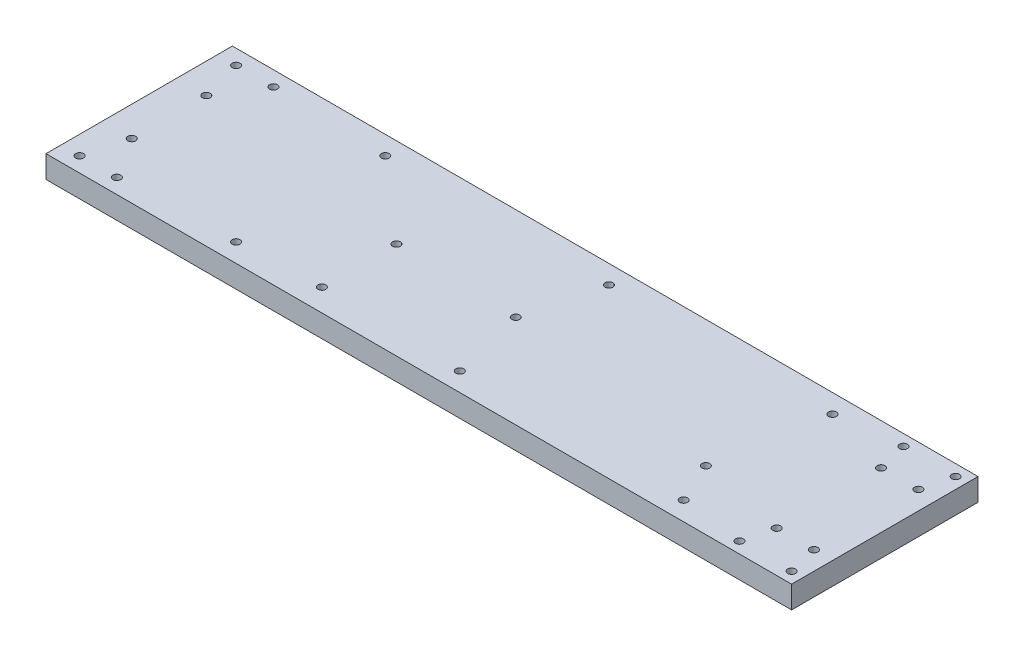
from build123d import *

# Parameters (mm, degrees)
ESQUISSE1_W             = 200
ESQUISSE1_H             = 50
EXTRUSION1_DEPTH        = 6
ESQUISSE2_R             = 1.05
ENL_V_MAT_EXTRU_1_DEPTH = 2


with BuildPart() as part:
    # Esquisse1 → Extrusion1 (new body)
    with BuildSketch(Plane(origin=(0, 0, 0), x_dir=(-1, 0, 0), z_dir=(0, 1, 0))):
        with Locations((-100, 0)):
            Rectangle(ESQUISSE1_W, ESQUISSE1_H)
    extrude(amount=-EXTRUSION1_DEPTH)

    # Esquisse2 → Enl_v. mat.-Extru.1 (cut)
    with BuildSketch(Plane(origin=(0, 0, 0), x_dir=(-1, 0, 0), z_dir=(0, 1, 0))):
        with Locations((-166, 19.95)):
            Circle(ESQUISSE2_R)
        with Locations((-106, 20)):
            Circle(ESQUISSE2_R)
        with Locations((-46, 20)):
            Circle(ESQUISSE2_R)
        with Locations((-5, 21)):
            Circle(ESQUISSE2_R)
        with Locations((-15, 21)):
            Circle(ESQUISSE2_R)
        with Locations((-197, 22)):
            Circle(ESQUISSE2_R)
        with Locations((-183, 22)):
            Circle(ESQUISSE2_R)
        with Locations(Location((-5, -21, 0), (0, 0, 180))):
            Circle(ESQUISSE2_R)
        with Locations(Location((-15, -21, 0), (0, 0, 180))):
            Circle(ESQUISSE2_R)
        with Locations(Location((-46, -20, 0), (0, 0, 180))):
            Circle(ESQUISSE2_R)
        with Locations(Location((-106, -20, 0), (0, 0, 180))):
            Circle(ESQUISSE2_R)
        with Locations(Location((-166, -19.95, 0), (0, 0, 180))):
            Circle(ESQUISSE2_R)
        with Locations(Location((-197, -22, 0), (0, 0, 180))):
            Circle(ESQUISSE2_R)
        with Locations(Location((-183, -22, 0), (0, 0, 180))):
            Circle(ESQUISSE2_R)
        with Locations((-195, 14)):
            Circle(ESQUISSE2_R)
        with Locations((-185, 14)):
            Circle(ESQUISSE2_R)
        with Locations(Location((-195, -14, 0), (0, 0, 180))):
            Circle(ESQUISSE2_R)
        with Locations(Location((-185, -14, 0), (0, 0, 180))):
            Circle(ESQUISSE2_R)
        with Locations((-8, 10)):
            Circle(ESQUISSE2_R)
        with Locations((-101, 0)):
            Circle(ESQUISSE2_R)
        with Locations(Location((-8, -10, 0), (0, 0, 180))):
            Circle(ESQUISSE2_R)
        with Locations((-161, 9)):
            Circle(ESQUISSE2_R)
        with Locations(Location((-68, -1, 0), (0, 0, 180))):
            Circle(ESQUISSE2_R)
        with Locations((-68, 19)):
            Circle(ESQUISSE2_R)
    extrude(amount=-ENL_V_MAT_EXTRU_1_DEPTH, mode=Mode.SUBTRACT)


solid = part.part
